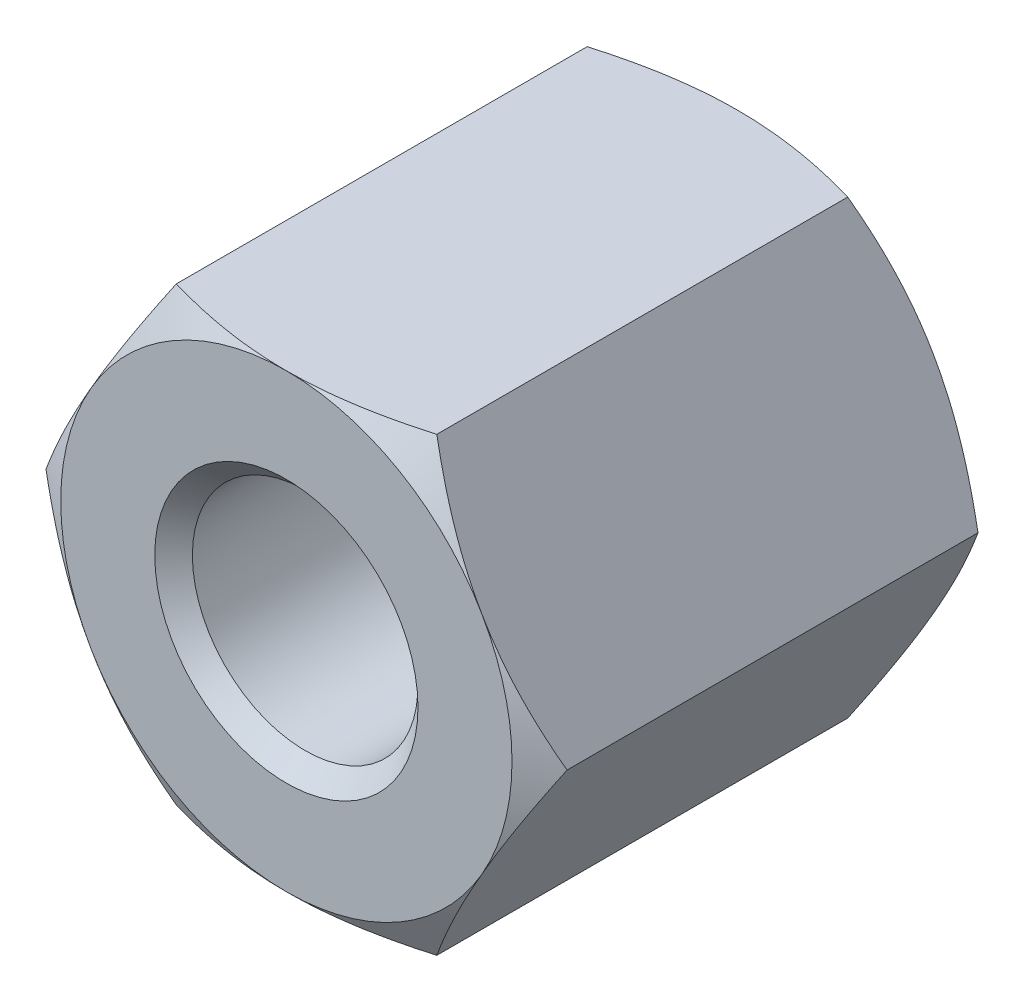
from build123d import *

# Parameters (mm, degrees)
BOSS_EXTRUDE1_DEPTH      = 3
SKETCH2_OUTSIDE_W        = 33.294
SKETCH2_OUTSIDE_H        = 32.366
SKETCH2_OUTSIDE_R        = 3
CUT_EXTRUDE1_DEPTH       = 6.477225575
CUT_EXTRUDE1_DRAFT       = -60
SKETCH3_R                = 1.5
SKETCH3_R_2              = 1.25
CUT_EXTRUDE2_DEPTH       = 3
SKETCH3_2_R              = 1.25
CUT_EXTRUDE3_DEPTH       = 3.75
CHAMFER1_SIZE            = 0.25
MIRROR1_COPY_1_SKETCH_W  = 33.294
MIRROR1_COPY_1_SKETCH_H  = 32.366
MIRROR1_COPY_1_SKETCH_R  = 3
MIRROR1_COPY_1_DEPTH     = 6.477225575
MIRROR1_COPY_1_DRAFT     = -60
CHAMFER1_OF_MIRROR1_SIZE = 0.25


with BuildPart() as part:
    # Sketch1 → Boss-Extrude1 (new body)
    with BuildSketch(Plane.XY):
        Polygon((1.732050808, 3), (-1.732050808, 3), (-3.464101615, 0), (-1.732050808, -3), (1.732050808, -3), (3.464101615, 0), align=None)
    boss_extrude1 = extrude(amount=-BOSS_EXTRUDE1_DEPTH)


with BuildPart() as cut_extrude1_tool:
    # Sketch2 outside → Cut-Extrude1 (with draft: the straight prism first)
    with BuildSketch(Plane(origin=(0, 0, -3), x_dir=(-1, 0, 0), z_dir=(0, 0, -1))):
        Rectangle(SKETCH2_OUTSIDE_W, SKETCH2_OUTSIDE_H)
        Circle(SKETCH2_OUTSIDE_R, mode=Mode.SUBTRACT)
    extrude(amount=-CUT_EXTRUDE1_DEPTH)
    # Cut-Extrude1: the draft: its side faces are tilted about the plane it starts from
    cut_extrude1_sides = [cut_extrude1_tool.faces().sort_by_distance(p)[0] for p in [
        (0, -16.183, 0.238612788),
        (-16.647, 0, 0.238612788),
        (0, 16.183, 0.238612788),
        (16.647, 0, 0.238612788),
        (3, 0, 0.238612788),
    ]]
    draft(cut_extrude1_sides, Plane(origin=(0, 0, -3), x_dir=(-1, 0, 0), z_dir=(0, 0, -1)), CUT_EXTRUDE1_DRAFT)


with BuildPart() as part_1:
    add(part.part)

    # Cut-Extrude1: cut by cut_extrude1_tool
    add(cut_extrude1_tool.part, mode=Mode.SUBTRACT)

    # Sketch3 → Cut-Extrude2 (cut)
    with BuildSketch(Plane(origin=(0, 0, -3), x_dir=(-1, 0, 0), z_dir=(0, 0, -1))):
        Circle(SKETCH3_R)
        Circle(SKETCH3_R_2, mode=Mode.SUBTRACT)
    cut_extrude2 = extrude(amount=-CUT_EXTRUDE2_DEPTH, mode=Mode.SUBTRACT)


with BuildPart() as cut_extrude2_piece_1:
    # of the separate pieces the step leaves, piece 1, a body of its own (cut_extrude2_pieces)
    add(part_1.part.solids().sort_by_distance((1.732050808, 3, 0))[0])

    # Chamfer1
    chamfer1_edges = [cut_extrude2_piece_1.edges().sort_by_distance(p)[0] for p in [
        (1.5, 0, -3),
    ]]
    chamfer(chamfer1_edges, length=CHAMFER1_SIZE)


with BuildPart() as cut_extrude2_piece_2:
    # of the separate pieces the step leaves, piece 2, a body of its own (cut_extrude2_pieces)
    add(part_1.part.solids().sort_by_distance((-1.25, 0, 0))[0])

    # Sketch3_2 → Cut-Extrude3 (cut)
    with BuildSketch(Plane(origin=(0, 0, -3), x_dir=(-1, 0, 0), z_dir=(0, 0, -1))):
        Circle(SKETCH3_2_R)
    cut_extrude3 = extrude(amount=-CUT_EXTRUDE3_DEPTH, mode=Mode.SUBTRACT)


with BuildPart() as cut_extrude2_piece_1_1:
    add(cut_extrude2_piece_1.part)

    # Mirror1: Boss-Extrude1, Cut-Extrude2, Cut-Extrude3 across plane
    add(boss_extrude1.mirror(Plane.XY))
    add(cut_extrude2.mirror(Plane.XY), mode=Mode.SUBTRACT)
    add(cut_extrude3.mirror(Plane.XY), mode=Mode.SUBTRACT)


with BuildPart() as mirror1_copy_1_tool:
    # Mirror1 copy 1 sketch → Mirror1 copy 1 (with draft: the straight prism first)
    with BuildSketch(Plane(origin=(0, 0, 3), x_dir=(-1, 0, 0), z_dir=(0, 0, 1))):
        Rectangle(MIRROR1_COPY_1_SKETCH_W, MIRROR1_COPY_1_SKETCH_H)
        Circle(MIRROR1_COPY_1_SKETCH_R, mode=Mode.SUBTRACT)
    extrude(amount=-MIRROR1_COPY_1_DEPTH)
    # Mirror1 copy 1: the draft: its side faces are tilted about the plane it starts from
    mirror1_copy_1_sides = [mirror1_copy_1_tool.faces().sort_by_distance(p)[0] for p in [
        (0, -16.183, -0.238612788),
        (-16.647, 0, -0.238612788),
        (0, 16.183, -0.238612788),
        (16.647, 0, -0.238612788),
        (3, 0, -0.238612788),
    ]]
    draft(mirror1_copy_1_sides, Plane(origin=(0, 0, 3), x_dir=(-1, 0, 0), z_dir=(0, 0, 1)), MIRROR1_COPY_1_DRAFT)


with BuildPart() as cut_extrude2_piece_1_2:
    add(cut_extrude2_piece_1_1.part)

    # Mirror1 copy 1: cut by mirror1_copy_1_tool
    add(mirror1_copy_1_tool.part, mode=Mode.SUBTRACT)

    # Chamfer1 of Mirror1
    chamfer1_of_mirror1_edges = [cut_extrude2_piece_1_2.edges().sort_by_distance(p)[0] for p in [
        (1.5, 0, 3),
    ]]
    chamfer(chamfer1_of_mirror1_edges, length=CHAMFER1_OF_MIRROR1_SIZE)


solid = cut_extrude2_piece_1_2.part
